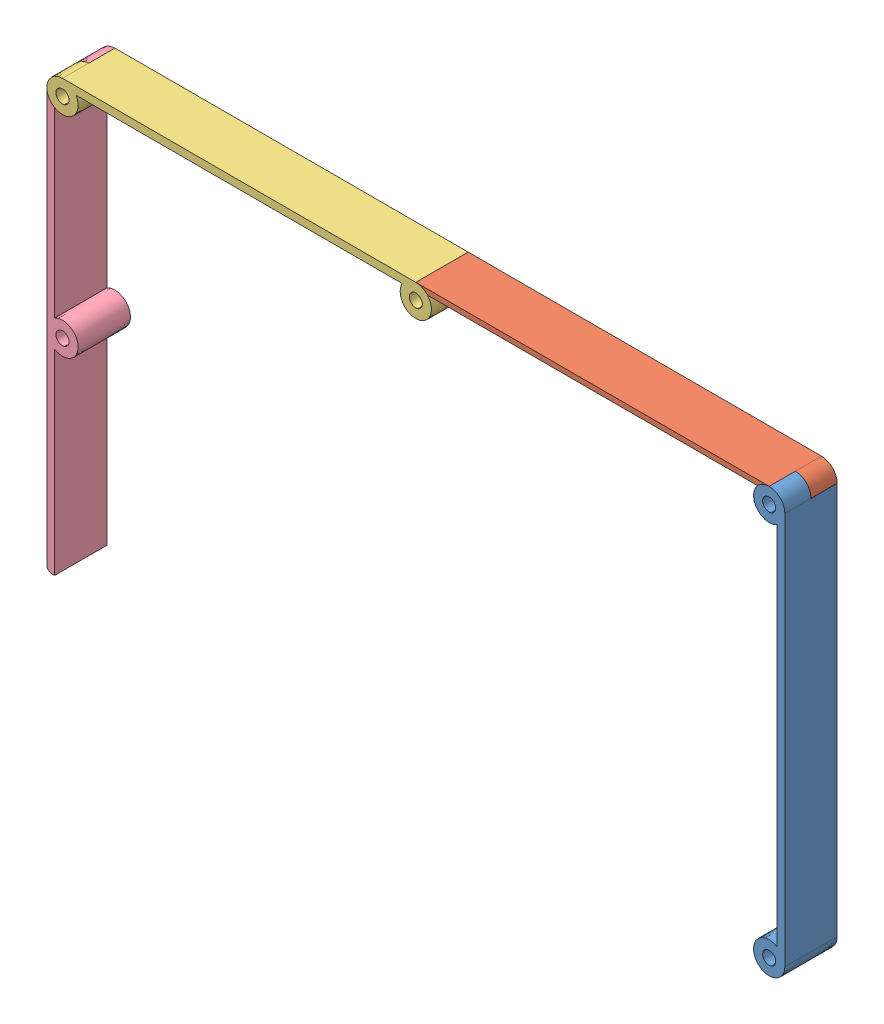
SolidWorks assembly Protection_v2.SLDASM, configuration Défaut (file format 12000). Lengths in mm.
Overall size (282 166 20).
4 component instances, 4 part files, 7 mates.
Components (placement in the parent):
- protection01_v2-1: protection01_v2.SLDPRT [Défaut] at origin size (12 162 20)
- protection02_v2-1: protection02_v2.SLDPRT [Défaut] at (0 150 0) size (147 12 20)
- protection03_v2-1: protection03_v2.SLDPRT [Défaut] at (-135 150 0) x (0 1 0) z (0 0 1) size (12 147 20)
- protection04_v2-1: protection04_v2.SLDPRT [Défaut] at (-270 70 20) x (-1 0 0) z (0 0 -1) size (12 166 20)
Mates (geometry in assembly coordinates):
- Coaxiale1: concentric aligned: cylinder of protection01_v2-1 through (0 150 20) axis (0 0 -1) radius 2.5; cylinder of protection02_v2-1 through (0 150 20) axis (0 0 -1) radius 2.5
- Coïncidente1: coincident anti-aligned: plane of protection01_v2-1 through (0 150 10) normal (0 0 -1); plane of protection02_v2-1 through (0 150 10) normal (0 0 1)
- Coaxiale2: concentric aligned: cylinder of protection02_v2-1 through (-135 150 20) axis (0 0 -1) radius 2.5; cylinder of protection03_v2-1 through (-135 150 20) axis (0 0 -1) radius 2.5
- Coïncidente2: coincident anti-aligned: plane of protection02_v2-1 through (-135 150 10) normal (0 0 1); plane of protection03_v2-1 through (-135 150 10) normal (0 0 -1)
- Coïncidente3: coincident anti-aligned: plane of protection03_v2-1 through (-270 150 10) normal (0 0 -1); plane of protection04_v2-1 through (-270 150 10) normal (0 0 1)
- Coaxiale3: concentric anti-aligned: cylinder of protection03_v2-1 through (-270 150 20) axis (0 0 -1) radius 2.5; cylinder of protection04_v2-1 through (-270 150 0) axis (0 0 1) radius 2.5
- Coaxiale5: concentric aligned: cylinder of protection01_v2-1 through (0 150 20) axis (0 0 -1) radius 2.5; cylinder of protection02_v2-1 through (0 150 20) axis (0 0 -1) radius 2.5
